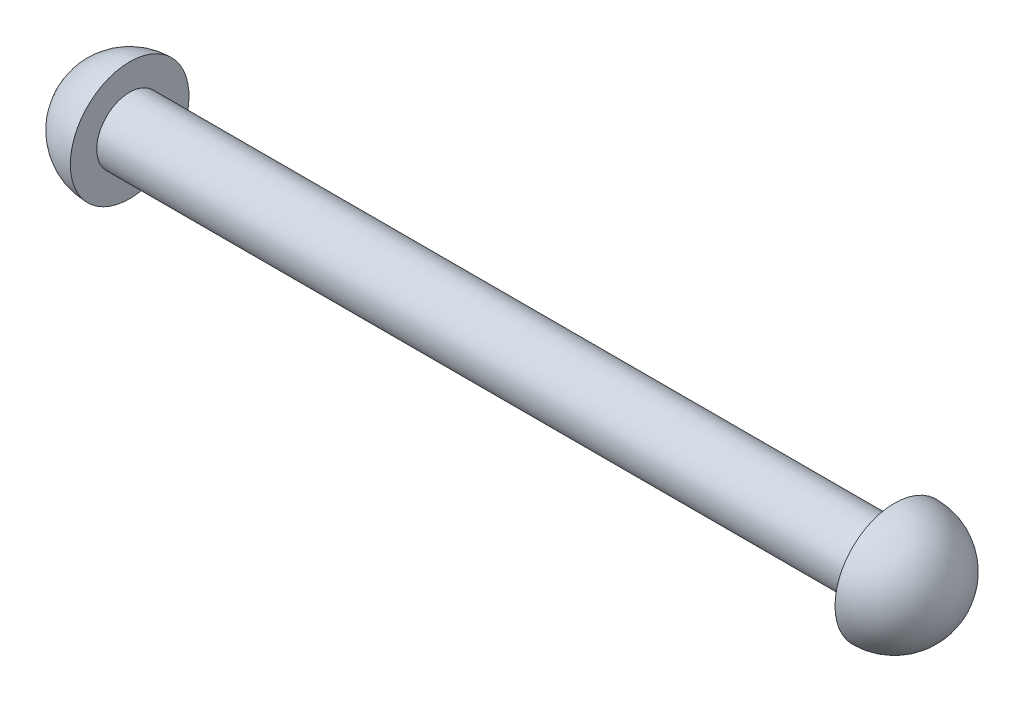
from build123d import *


with BuildPart() as part:
    # Sketch1 → Revolve1 (revolve)
    with BuildSketch(Plane.XY):
        with BuildLine():
            Line((36.83, 0), (-36.83, 0))
            Line((-36.83, 0), (-36.83, 2.54))
            ThreePointArc((-36.83, 2.54), (-40.871115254, 0.866115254), (-42.545, -3.175))
            Line((-42.545, -3.175), (42.545, -3.175))
            ThreePointArc((42.545, -3.175), (40.871115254, 0.866115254), (36.83, 2.54))
            Line((36.83, 2.54), (36.83, 0))
        make_face()
    revolve(axis=Axis((-42.545, -3.175, 0), (1, 0, 0)))


solid = part.part
